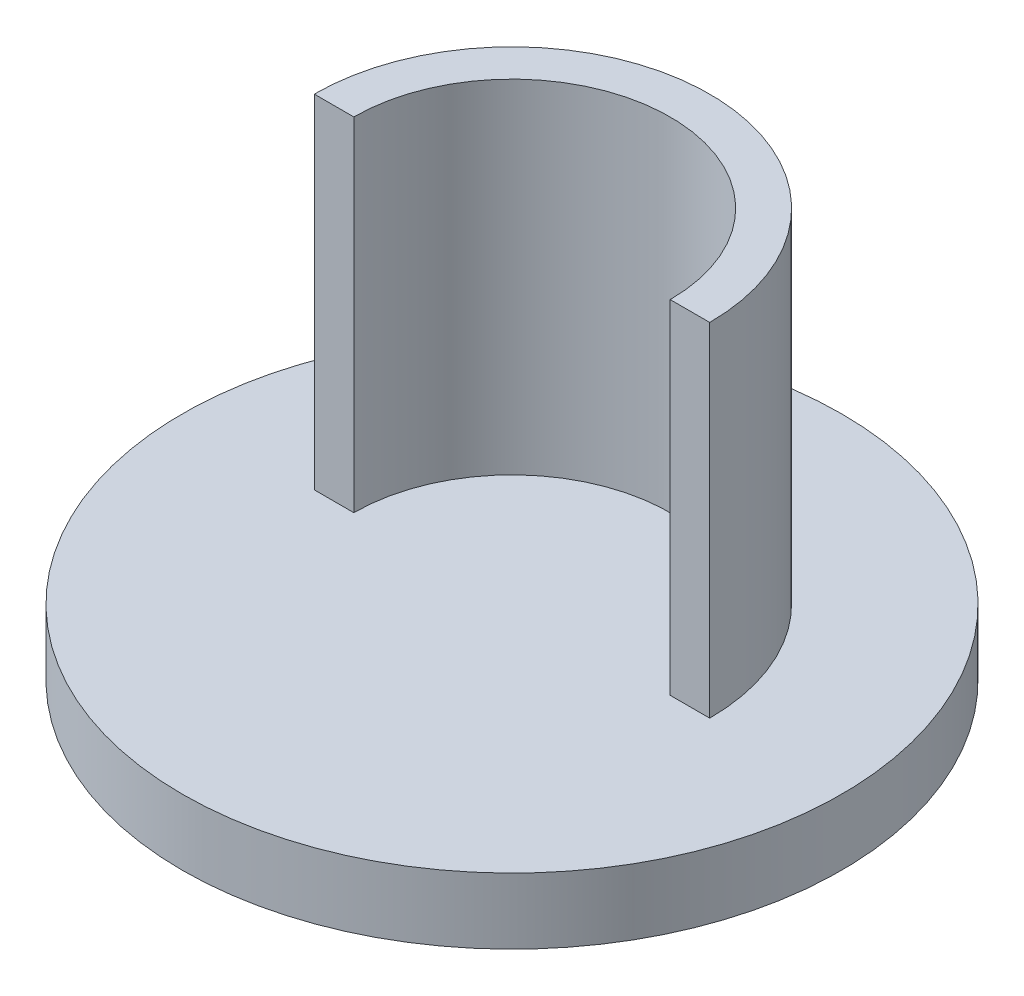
from build123d import *

# Parameters (mm, degrees)
SKETCH1_R           = 25
EXTRUDE1_DEPTH      = 5
EXTRUDE_THIN1_DEPTH = 26


with BuildPart() as part:
    # Sketch1 → Extrude1 (new body)
    with BuildSketch(Plane(origin=(0, 0, 0), x_dir=(1, 0, 0), z_dir=(0, 1, 0))):
        with Locations(Location((0, 0, 0), (0, 0, 270))):
            Circle(SKETCH1_R)
    extrude(amount=EXTRUDE1_DEPTH)

    # Sketch2 → Extrude-Thin1 (add)
    with BuildSketch(Plane(origin=(0, 5, 0), x_dir=(-1, 0, 0), z_dir=(0, 1, 0))):
        with BuildLine():
            ThreePointArc((15, 0), (0, -15), (-15, 0))
            Line((-15, 0), (-12, 0))
            ThreePointArc((-12, 0), (0, -12), (12, 0))
            Line((12, 0), (15, 0))
        make_face()
    extrude(amount=EXTRUDE_THIN1_DEPTH)


solid = part.part
